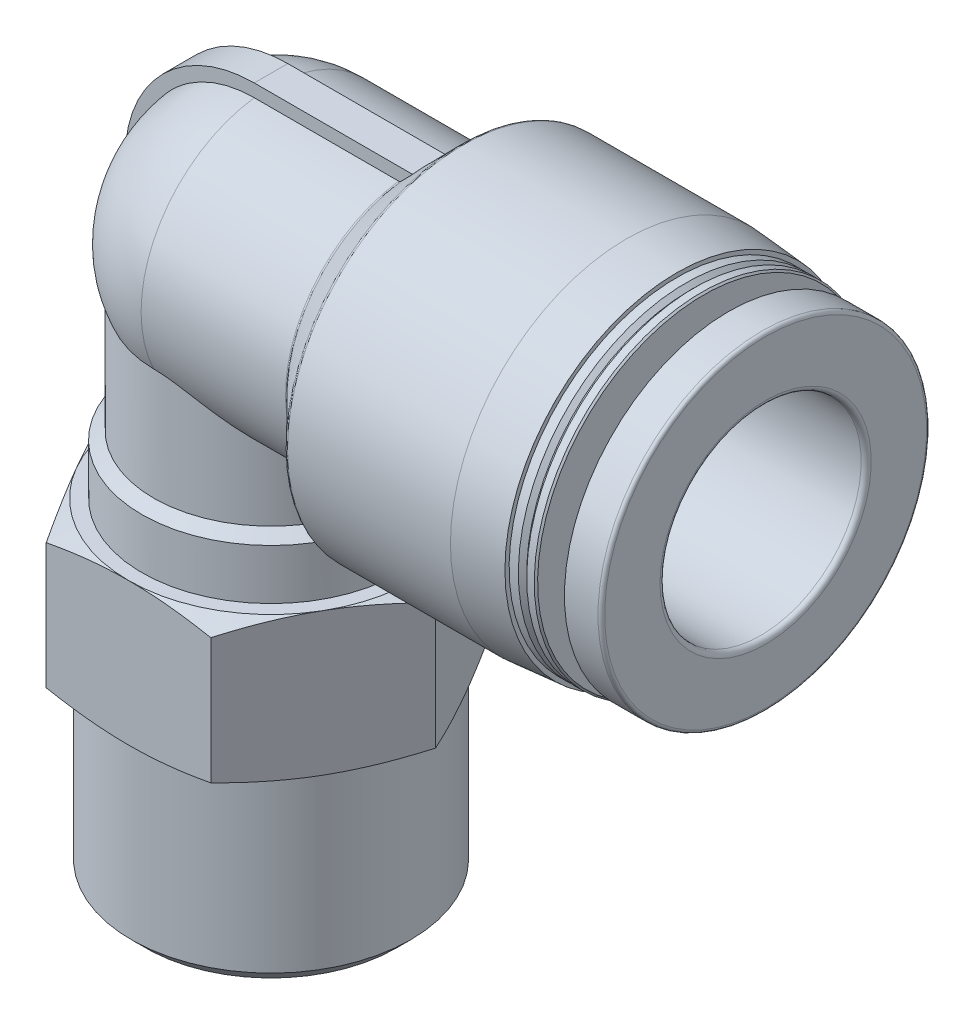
from build123d import *

# Parameters (mm, degrees)
EXTRUDE_1_DEPTH      = 1
EXTRUDE_1_DEPTH_BACK = 1
SKETCH_6_R           = 17
CUT_EXTRUDE_1_DEPTH  = 11.5


with BuildPart() as part:
    # Sketch 1 → Revolve 1 (revolve)
    with BuildSketch(Plane.XY, mode=Mode.PRIVATE) as revolve_1_sk:
        with BuildLine():
            Line((-7, 0), (-7, 0.75))
            ThreePointArc((-7, 0.75), (-4.949747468, 5.699747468), (0, 7.75))
            Line((0, 7.75), (8.613715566, 7.75))
            ThreePointArc((8.613715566, 7.75), (8.691057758, 7.765559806), (8.756365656, 7.809818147))
            Line((8.756365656, 7.809818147), (11.341216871, 10.440181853))
            ThreePointArc((11.341216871, 10.440181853), (11.406524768, 10.484440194), (11.48386696, 10.5))
            Line((11.48386696, 10.5), (21.2, 10.5))
            Line((21.2, 10.5), (24.2, 10.25))
            Line((24.2, 10.25), (24.2, 10))
            Line((24.2, 10), (24.75, 10))
            Line((24.75, 10), (25, 9.75))
            Line((25, 9.75), (25.25, 10))
            Line((25.25, 10), (25.7, 10))
            Line((25.7, 10), (25.8, 9.9))
            Line((25.8, 9.9), (25.8, 7.45))
            Line((25.8, 7.45), (27.3, 7.45))
            Line((27.3, 7.45), (27.3, 9.8))
            Line((27.3, 9.8), (29.3, 9.8))
            ThreePointArc((29.3, 9.8), (29.441421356, 9.741421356), (29.5, 9.6))
            Line((29.5, 9.6), (29.5, 0))
            Line((29.5, 0), (-7, 0))
        make_face()
    revolve(revolve_1_sk.sketch.rotate(Axis((29.5, 0, 0), (-1, 0, 0)), 180), axis=Axis((29.5, 0, 0), (-1, 0, 0)))

    # Sketch 2 → Revolve 2 (revolve)
    with BuildSketch(Plane.XY, mode=Mode.PRIVATE) as revolve_2_sk:
        Polygon((0, -33), (-7.475, -33), (-8.331, -32.144), (-8.331, -22), (-8.5, -22), (-9.814954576, -21.5), (-9.814954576, -14), (-8.5, -13.5), (-7.7, -13.5), (-7.7, -10.5), (-7, -10), (-7, -1.6), (0, -1.6), align=None)
    revolve(revolve_2_sk.sketch.rotate(Axis((0, -1.6, 0), (0, -1, 0)), 180), axis=Axis((0, -1.6, 0), (0, -1, 0)))

    # Sketch 3 → Extrude 1 (add, two sides: drawn at the far end of the back side and taken through both)
    with BuildSketch(Plane.XY.offset(-EXTRUDE_1_DEPTH_BACK)):
        with BuildLine():
            Line((-7.7, 0.75), (-7.7, -10.5))
            Line((-7.7, -10.5), (0, -10.5))
            Line((0, -10.5), (0, 0))
            Line((0, 0), (10.4, 0))
            Line((10.4, 0), (10.4, 8.45))
            Line((10.4, 8.45), (0, 8.45))
            ThreePointArc((0, 8.45), (-5.444722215, 6.194722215), (-7.7, 0.75))
        make_face()
    extrude(amount=EXTRUDE_1_DEPTH + EXTRUDE_1_DEPTH_BACK)

    # Sketch 4 → Cut-Revolve 1 (revolve, cut)
    with BuildSketch(Plane.XY, mode=Mode.PRIVATE) as cut_revolve_1_sk:
        with BuildLine():
            Line((0, 0), (0, 5))
            Line((0, 5), (6.3, 5))
            ThreePointArc((6.3, 5), (6.441421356, 5.058578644), (6.5, 5.2))
            Line((6.5, 5.2), (6.5, 5.8))
            ThreePointArc((6.5, 5.8), (6.558578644, 5.941421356), (6.7, 6))
            Line((6.7, 6), (29.2, 6))
            ThreePointArc((29.2, 6), (29.412132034, 6.087867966), (29.5, 6.3))
            Line((29.5, 6.3), (29.5, 0))
            Line((29.5, 0), (0, 0))
        make_face()
    revolve(cut_revolve_1_sk.sketch.rotate(Axis((29.5, 0, 0), (-1, 0, 0)), 270), axis=Axis((29.5, 0, 0), (-1, 0, 0)), mode=Mode.SUBTRACT)

    # Sketch 5 → Cut-Revolve 2 (revolve, cut)
    with BuildSketch(Plane.XY, mode=Mode.PRIVATE) as cut_revolve_2_sk:
        with BuildLine():
            Line((0, -33), (-5.8, -33))
            Line((-5.8, -33), (-5.5, -32.7))
            Line((-5.5, -32.7), (-5.5, -19.7))
            Line((-5.5, -19.7), (-5, -19.7))
            Line((-5, -19.7), (-5, 0))
            ThreePointArc((-5, 0), (-3.535533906, 3.535533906), (0, 5))
            Line((0, 5), (0, -33))
        make_face()
    revolve(cut_revolve_2_sk.sketch.rotate(Axis((0, 5, 0), (0, -1, 0)), 90), axis=Axis((0, 5, 0), (0, -1, 0)), mode=Mode.SUBTRACT)

    # Sketch 6 → Cut-Extrude 1 (cut)
    with BuildSketch(Plane(origin=(0, -22, 0), x_dir=(1, 0, 0), z_dir=(0, 1, 0))):
        Circle(SKETCH_6_R)
        Polygon((-9.814954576, 0), (-4.907477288, -8.5), (4.907477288, -8.5), (9.814954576, 0), (4.907477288, 8.5), (-4.907477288, 8.5), align=None, mode=Mode.SUBTRACT)
    extrude(amount=CUT_EXTRUDE_1_DEPTH, mode=Mode.SUBTRACT)


solid = part.part
